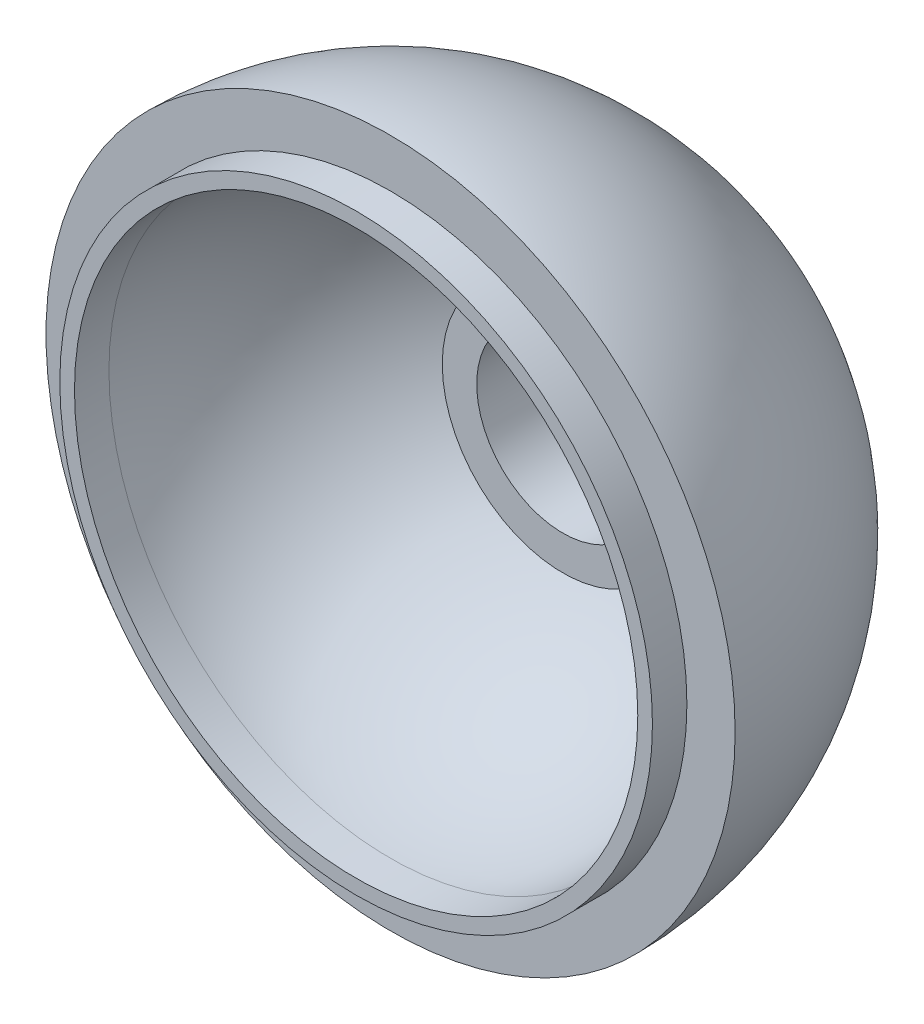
ISO-10303-21;
HEADER;
FILE_DESCRIPTION(('STEP AP214'),'2;1');
FILE_NAME('part.step','',(''),(''),'','','');
FILE_SCHEMA(('AUTOMOTIVE_DESIGN { 1 0 10303 214 1 1 1 1 }'));
ENDSEC;
DATA;
#1=APPLICATION_CONTEXT('core data for automotive mechanical design processes');
#2=APPLICATION_PROTOCOL_DEFINITION('international standard','automotive_design',2000,#1);
#3=PRODUCT_CONTEXT('',#1,'mechanical');
#4=PRODUCT('Part','Part','',(#3));
#5=PRODUCT_RELATED_PRODUCT_CATEGORY('part','',(#4));
#6=PRODUCT_DEFINITION_FORMATION('','',#4);
#7=PRODUCT_DEFINITION_CONTEXT('part definition',#1,'design');
#8=PRODUCT_DEFINITION('design','',#6,#7);
#9=PRODUCT_DEFINITION_SHAPE('','',#8);
#10=(LENGTH_UNIT() NAMED_UNIT(*) SI_UNIT(.MILLI.,.METRE.));
#11=(NAMED_UNIT(*) PLANE_ANGLE_UNIT() SI_UNIT($,.RADIAN.));
#12=(NAMED_UNIT(*) SI_UNIT($,.STERADIAN.) SOLID_ANGLE_UNIT());
#13=UNCERTAINTY_MEASURE_WITH_UNIT(LENGTH_MEASURE(1.E-05),#10,'distance_accuracy_value','');
#14=(GEOMETRIC_REPRESENTATION_CONTEXT(3) GLOBAL_UNCERTAINTY_ASSIGNED_CONTEXT((#13)) GLOBAL_UNIT_ASSIGNED_CONTEXT((#10,
#11,#12)) REPRESENTATION_CONTEXT('',''));
#15=CARTESIAN_POINT('',(0.,0.,0.));
#16=DIRECTION('',(0.,0.,1.));
#17=DIRECTION('',(1.,0.,0.));
#18=AXIS2_PLACEMENT_3D('',#15,#16,#17);
#19=CARTESIAN_POINT('',(-8.6,0.,1.));
#20=DIRECTION('',(0.,0.,-1.));
#21=DIRECTION('',(-1.,0.,0.));
#22=AXIS2_PLACEMENT_3D('',#19,#20,#21);
#23=PLANE('',#22);
#24=CARTESIAN_POINT('',(0.,0.,1.));
#25=DIRECTION('',(0.,0.,1.));
#26=DIRECTION('',(1.,0.,0.));
#27=AXIS2_PLACEMENT_3D('',#24,#25,#26);
#28=CIRCLE('',#27,8.17445673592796);
#29=CARTESIAN_POINT('',(8.17445673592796,0.,1.));
#30=VERTEX_POINT('',#29);
#31=EDGE_CURVE('E10',#30,#30,#28,.T.);
#32=ORIENTED_EDGE('',*,*,#31,.F.);
#33=EDGE_LOOP('',(#32));
#34=FACE_BOUND('',#33,.T.);
#35=CARTESIAN_POINT('',(0.,0.,1.));
#36=DIRECTION('',(0.,0.,1.));
#37=DIRECTION('',(1.,0.,0.));
#38=AXIS2_PLACEMENT_3D('',#35,#36,#37);
#39=CIRCLE('',#38,8.6);
#40=CARTESIAN_POINT('',(8.6,0.,1.));
#41=VERTEX_POINT('',#40);
#42=EDGE_CURVE('E60',#41,#41,#39,.T.);
#43=ORIENTED_EDGE('',*,*,#42,.T.);
#44=EDGE_LOOP('',(#43));
#45=FACE_BOUND('',#44,.T.);
#46=ADVANCED_FACE('F29',(#34,#45),#23,.F.);
#47=CARTESIAN_POINT('',(0.,0.,0.));
#48=DIRECTION('',(0.,0.,1.));
#49=DIRECTION('',(1.,0.,0.));
#50=AXIS2_PLACEMENT_3D('',#47,#48,#49);
#51=CYLINDRICAL_SURFACE('',#50,8.17445673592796);
#52=CARTESIAN_POINT('',(0.,0.,0.));
#53=DIRECTION('',(0.,0.,1.));
#54=DIRECTION('',(1.,0.,0.));
#55=AXIS2_PLACEMENT_3D('',#52,#53,#54);
#56=CIRCLE('',#55,8.17445673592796);
#57=CARTESIAN_POINT('',(8.17445673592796,0.,0.));
#58=VERTEX_POINT('',#57);
#59=EDGE_CURVE('E35',#58,#58,#56,.T.);
#60=ORIENTED_EDGE('',*,*,#59,.F.);
#61=EDGE_LOOP('',(#60));
#62=FACE_BOUND('',#61,.T.);
#63=ORIENTED_EDGE('',*,*,#31,.T.);
#64=EDGE_LOOP('',(#63));
#65=FACE_BOUND('',#64,.T.);
#66=ADVANCED_FACE('F88',(#62,#65),#51,.F.);
#67=CARTESIAN_POINT('',(0.,0.,0.));
#68=DIRECTION('',(0.,0.,1.));
#69=DIRECTION('',(-1.,0.,0.));
#70=AXIS2_PLACEMENT_3D('',#67,#68,#69);
#71=SPHERICAL_SURFACE('',#70,8.17445673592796);
#72=CARTESIAN_POINT('',(0.,0.,-7.38726897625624));
#73=DIRECTION('',(0.,0.,1.));
#74=DIRECTION('',(1.,0.,0.));
#75=AXIS2_PLACEMENT_3D('',#72,#73,#74);
#76=CIRCLE('',#75,3.5);
#77=CARTESIAN_POINT('',(3.5,0.,-7.38726897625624));
#78=VERTEX_POINT('',#77);
#79=EDGE_CURVE('E39',#78,#78,#76,.T.);
#80=ORIENTED_EDGE('',*,*,#79,.F.);
#81=EDGE_LOOP('',(#80));
#82=FACE_BOUND('',#81,.T.);
#83=ORIENTED_EDGE('',*,*,#59,.T.);
#84=EDGE_LOOP('',(#83));
#85=FACE_BOUND('',#84,.T.);
#86=ADVANCED_FACE('F93',(#82,#85),#71,.F.);
#87=CARTESIAN_POINT('',(0.,0.,0.));
#88=DIRECTION('',(0.,0.,1.));
#89=DIRECTION('',(1.,0.,0.));
#90=AXIS2_PLACEMENT_3D('',#87,#88,#89);
#91=CYLINDRICAL_SURFACE('',#90,3.5);
#92=CARTESIAN_POINT('',(0.,0.,-5.));
#93=DIRECTION('',(0.,0.,1.));
#94=DIRECTION('',(1.,0.,0.));
#95=AXIS2_PLACEMENT_3D('',#92,#93,#94);
#96=CIRCLE('',#95,3.5);
#97=CARTESIAN_POINT('',(3.5,0.,-5.));
#98=VERTEX_POINT('',#97);
#99=EDGE_CURVE('E43',#98,#98,#96,.T.);
#100=ORIENTED_EDGE('',*,*,#99,.F.);
#101=EDGE_LOOP('',(#100));
#102=FACE_BOUND('',#101,.T.);
#103=ORIENTED_EDGE('',*,*,#79,.T.);
#104=EDGE_LOOP('',(#103));
#105=FACE_BOUND('',#104,.T.);
#106=ADVANCED_FACE('F98',(#102,#105),#91,.T.);
#107=CARTESIAN_POINT('',(-2.5,0.,-5.));
#108=DIRECTION('',(0.,0.,-1.));
#109=DIRECTION('',(-1.,0.,0.));
#110=AXIS2_PLACEMENT_3D('',#107,#108,#109);
#111=PLANE('',#110);
#112=CARTESIAN_POINT('',(0.,0.,-5.));
#113=DIRECTION('',(0.,0.,1.));
#114=DIRECTION('',(1.,0.,0.));
#115=AXIS2_PLACEMENT_3D('',#112,#113,#114);
#116=CIRCLE('',#115,2.5);
#117=CARTESIAN_POINT('',(2.5,0.,-5.));
#118=VERTEX_POINT('',#117);
#119=EDGE_CURVE('E48',#118,#118,#116,.T.);
#120=ORIENTED_EDGE('',*,*,#119,.F.);
#121=EDGE_LOOP('',(#120));
#122=FACE_BOUND('',#121,.T.);
#123=ORIENTED_EDGE('',*,*,#99,.T.);
#124=EDGE_LOOP('',(#123));
#125=FACE_BOUND('',#124,.T.);
#126=ADVANCED_FACE('F104',(#122,#125),#111,.F.);
#127=CARTESIAN_POINT('',(0.,0.,0.));
#128=DIRECTION('',(0.,0.,1.));
#129=DIRECTION('',(1.,0.,0.));
#130=AXIS2_PLACEMENT_3D('',#127,#128,#129);
#131=CYLINDRICAL_SURFACE('',#130,2.5);
#132=CARTESIAN_POINT('',(0.,0.,-7.78278503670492));
#133=DIRECTION('',(0.,0.,1.));
#134=DIRECTION('',(1.,0.,0.));
#135=AXIS2_PLACEMENT_3D('',#132,#133,#134);
#136=CIRCLE('',#135,2.5);
#137=CARTESIAN_POINT('',(2.5,0.,-7.78278503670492));
#138=VERTEX_POINT('',#137);
#139=EDGE_CURVE('E51',#138,#138,#136,.T.);
#140=ORIENTED_EDGE('',*,*,#139,.F.);
#141=EDGE_LOOP('',(#140));
#142=FACE_BOUND('',#141,.T.);
#143=ORIENTED_EDGE('',*,*,#119,.T.);
#144=EDGE_LOOP('',(#143));
#145=FACE_BOUND('',#144,.T.);
#146=ADVANCED_FACE('F84',(#142,#145),#131,.F.);
#147=CARTESIAN_POINT('',(0.,0.,0.));
#148=DIRECTION('',(0.,0.,1.));
#149=DIRECTION('',(-1.,0.,0.));
#150=AXIS2_PLACEMENT_3D('',#147,#148,#149);
#151=SPHERICAL_SURFACE('',#150,8.17445673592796);
#152=ORIENTED_EDGE('',*,*,#139,.T.);
#153=EDGE_LOOP('',(#152));
#154=FACE_BOUND('',#153,.T.);
#155=ADVANCED_FACE('F79',(#154),#151,.F.);
#156=CARTESIAN_POINT('',(0.,0.,0.));
#157=DIRECTION('',(0.,0.,1.));
#158=DIRECTION('',(1.,0.,0.));
#159=AXIS2_PLACEMENT_3D('',#156,#157,#158);
#160=SPHERICAL_SURFACE('',#159,10.);
#161=CARTESIAN_POINT('',(0.,0.,0.));
#162=DIRECTION('',(0.,0.,1.));
#163=DIRECTION('',(1.,0.,0.));
#164=AXIS2_PLACEMENT_3D('',#161,#162,#163);
#165=CIRCLE('',#164,10.);
#166=CARTESIAN_POINT('',(10.,0.,0.));
#167=VERTEX_POINT('',#166);
#168=EDGE_CURVE('E54',#167,#167,#165,.T.);
#169=ORIENTED_EDGE('',*,*,#168,.F.);
#170=EDGE_LOOP('',(#169));
#171=FACE_BOUND('',#170,.T.);
#172=ADVANCED_FACE('F74',(#171),#160,.T.);
#173=CARTESIAN_POINT('',(-10.,0.,0.));
#174=DIRECTION('',(0.,0.,-1.));
#175=DIRECTION('',(-1.,0.,0.));
#176=AXIS2_PLACEMENT_3D('',#173,#174,#175);
#177=PLANE('',#176);
#178=CARTESIAN_POINT('',(0.,0.,0.));
#179=DIRECTION('',(0.,0.,1.));
#180=DIRECTION('',(1.,0.,0.));
#181=AXIS2_PLACEMENT_3D('',#178,#179,#180);
#182=CIRCLE('',#181,8.6);
#183=CARTESIAN_POINT('',(8.6,0.,0.));
#184=VERTEX_POINT('',#183);
#185=EDGE_CURVE('E57',#184,#184,#182,.T.);
#186=ORIENTED_EDGE('',*,*,#185,.F.);
#187=EDGE_LOOP('',(#186));
#188=FACE_BOUND('',#187,.T.);
#189=ORIENTED_EDGE('',*,*,#168,.T.);
#190=EDGE_LOOP('',(#189));
#191=FACE_BOUND('',#190,.T.);
#192=ADVANCED_FACE('F68',(#188,#191),#177,.F.);
#193=CARTESIAN_POINT('',(0.,0.,0.));
#194=DIRECTION('',(0.,0.,1.));
#195=DIRECTION('',(1.,0.,0.));
#196=AXIS2_PLACEMENT_3D('',#193,#194,#195);
#197=CYLINDRICAL_SURFACE('',#196,8.6);
#198=ORIENTED_EDGE('',*,*,#42,.F.);
#199=EDGE_LOOP('',(#198));
#200=FACE_BOUND('',#199,.T.);
#201=ORIENTED_EDGE('',*,*,#185,.T.);
#202=EDGE_LOOP('',(#201));
#203=FACE_BOUND('',#202,.T.);
#204=ADVANCED_FACE('F65',(#200,#203),#197,.T.);
#205=CLOSED_SHELL('',(#46,#66,#86,#106,#126,#146,#155,#172,#192,#204));
#206=MANIFOLD_SOLID_BREP('B2',#205);
#207=ADVANCED_BREP_SHAPE_REPRESENTATION('',(#18,#206),#14);
#208=SHAPE_DEFINITION_REPRESENTATION(#9,#207);
ENDSEC;
END-ISO-10303-21;
